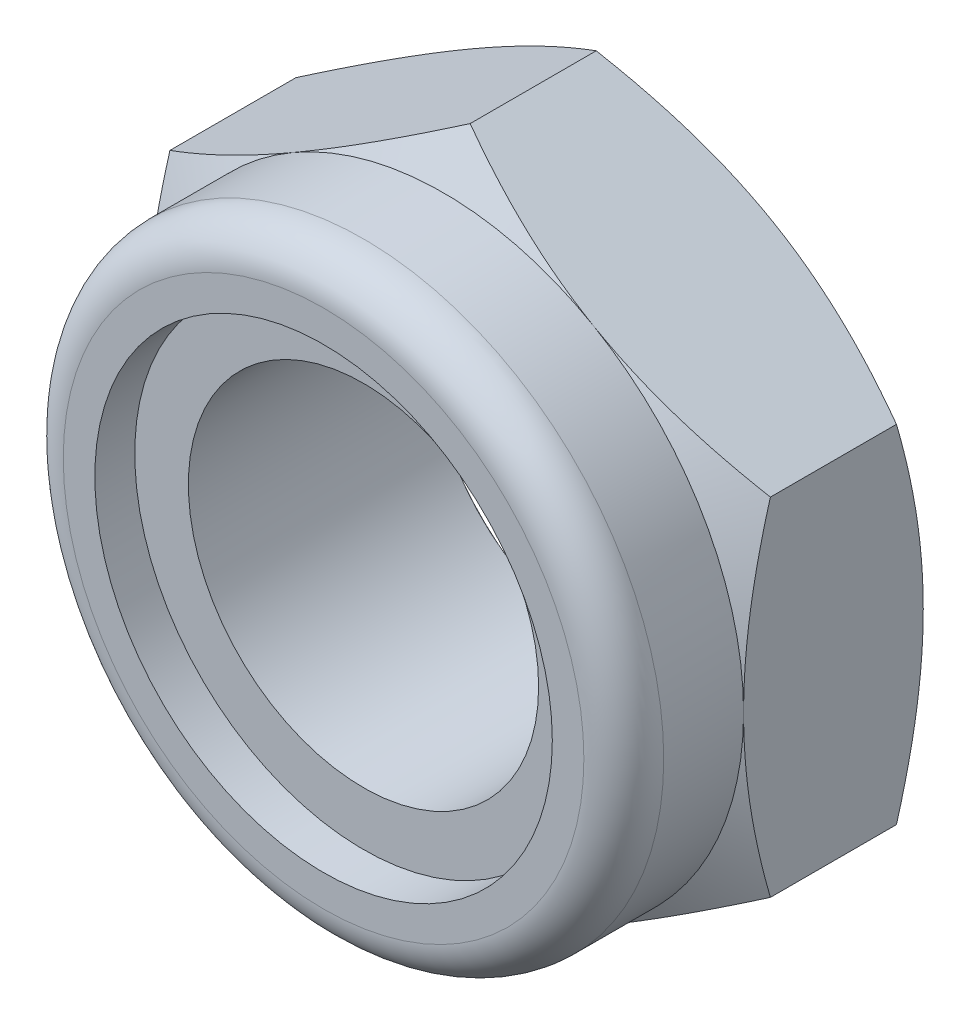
ISO-10303-21;
HEADER;
FILE_DESCRIPTION(('STEP AP214'),'2;1');
FILE_NAME('part.step','',(''),(''),'','','');
FILE_SCHEMA(('AUTOMOTIVE_DESIGN { 1 0 10303 214 1 1 1 1 }'));
ENDSEC;
DATA;
#1=APPLICATION_CONTEXT('core data for automotive mechanical design processes');
#2=APPLICATION_PROTOCOL_DEFINITION('international standard','automotive_design',2000,#1);
#3=PRODUCT_CONTEXT('',#1,'mechanical');
#4=PRODUCT('Part','Part','',(#3));
#5=PRODUCT_RELATED_PRODUCT_CATEGORY('part','',(#4));
#6=PRODUCT_DEFINITION_FORMATION('','',#4);
#7=PRODUCT_DEFINITION_CONTEXT('part definition',#1,'design');
#8=PRODUCT_DEFINITION('design','',#6,#7);
#9=PRODUCT_DEFINITION_SHAPE('','',#8);
#10=(LENGTH_UNIT() NAMED_UNIT(*) SI_UNIT(.MILLI.,.METRE.));
#11=(NAMED_UNIT(*) PLANE_ANGLE_UNIT() SI_UNIT($,.RADIAN.));
#12=(NAMED_UNIT(*) SI_UNIT($,.STERADIAN.) SOLID_ANGLE_UNIT());
#13=UNCERTAINTY_MEASURE_WITH_UNIT(LENGTH_MEASURE(1.E-05),#10,'distance_accuracy_value','');
#14=(GEOMETRIC_REPRESENTATION_CONTEXT(3) GLOBAL_UNCERTAINTY_ASSIGNED_CONTEXT((#13)) GLOBAL_UNIT_ASSIGNED_CONTEXT((#10,
#11,#12)) REPRESENTATION_CONTEXT('',''));
#15=CARTESIAN_POINT('',(0.,0.,0.));
#16=DIRECTION('',(0.,0.,1.));
#17=DIRECTION('',(1.,0.,0.));
#18=AXIS2_PLACEMENT_3D('',#15,#16,#17);
#19=CARTESIAN_POINT('',(0.,0.,-11.4));
#20=DIRECTION('',(0.,0.,1.));
#21=DIRECTION('',(1.,0.,0.));
#22=AXIS2_PLACEMENT_3D('',#19,#20,#21);
#23=CYLINDRICAL_SURFACE('',#22,11.1125);
#24=CARTESIAN_POINT('',(0.,0.,5.06666666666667));
#25=DIRECTION('',(0.,0.,1.));
#26=DIRECTION('',(1.,0.,0.));
#27=AXIS2_PLACEMENT_3D('',#24,#25,#26);
#28=CIRCLE('',#27,11.1125);
#29=CARTESIAN_POINT('',(11.1125,0.,5.06666666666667));
#30=VERTEX_POINT('',#29);
#31=EDGE_CURVE('E277',#30,#30,#28,.T.);
#32=ORIENTED_EDGE('',*,*,#31,.T.);
#33=EDGE_LOOP('',(#32));
#34=FACE_BOUND('',#33,.T.);
#35=CARTESIAN_POINT('',(0.,0.,-10.2630205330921));
#36=DIRECTION('',(0.,0.,-1.));
#37=DIRECTION('',(-1.,0.,0.));
#38=AXIS2_PLACEMENT_3D('',#35,#36,#37);
#39=CIRCLE('',#38,11.1125);
#40=CARTESIAN_POINT('',(-11.1125,0.,-10.2630205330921));
#41=VERTEX_POINT('',#40);
#42=EDGE_CURVE('E39',#41,#41,#39,.F.);
#43=ORIENTED_EDGE('',*,*,#42,.F.);
#44=EDGE_LOOP('',(#43));
#45=FACE_BOUND('',#44,.T.);
#46=ADVANCED_FACE('F34',(#34,#45),#23,.F.);
#47=CARTESIAN_POINT('',(0.,21.9970452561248,-11.4));
#48=DIRECTION('',(-0.500000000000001,0.866025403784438,0.));
#49=DIRECTION('',(-0.866025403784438,-0.500000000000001,0.));
#50=AXIS2_PLACEMENT_3D('',#47,#48,#49);
#51=PLANE('',#50);
#52=DIRECTION('',(0.,0.,1.));
#53=VECTOR('',#52,1.);
#54=CARTESIAN_POINT('',(-19.05,10.9985226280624,-11.4));
#55=LINE('',#54,#53);
#56=CARTESIAN_POINT('',(-19.05,10.9985226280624,-9.69852262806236));
#57=VERTEX_POINT('',#56);
#58=CARTESIAN_POINT('',(-19.05,10.9985226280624,-1.70147737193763));
#59=VERTEX_POINT('',#58);
#60=EDGE_CURVE('E249',#57,#59,#55,.T.);
#61=ORIENTED_EDGE('',*,*,#60,.T.);
#62=CARTESIAN_POINT('',(-19.0502,10.9984071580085,-1.70154403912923));
#63=CARTESIAN_POINT('',(-18.6314889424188,11.2401500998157,-1.56198341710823));
#64=CARTESIAN_POINT('',(-18.2111446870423,11.4828359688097,-1.42875584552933));
#65=CARTESIAN_POINT('',(-17.3670855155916,11.9701537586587,-1.17672716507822));
#66=CARTESIAN_POINT('',(-16.9433695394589,12.2147862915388,-1.05793080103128));
#67=CARTESIAN_POINT('',(-16.0917480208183,12.7064702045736,-0.836361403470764));
#68=CARTESIAN_POINT('',(-15.6638350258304,12.9535258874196,-0.733626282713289));
#69=CARTESIAN_POINT('',(-14.8050356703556,13.4493539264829,-0.546385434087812));
#70=CARTESIAN_POINT('',(-14.374149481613,13.6981261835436,-0.461878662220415));
#71=CARTESIAN_POINT('',(-13.5204444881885,14.1910129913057,-0.314688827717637));
#72=CARTESIAN_POINT('',(-13.0976890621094,14.4350909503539,-0.2515185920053));
#73=CARTESIAN_POINT('',(-12.250241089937,14.9243652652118,-0.14559634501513));
#74=CARTESIAN_POINT('',(-11.8255485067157,15.1695616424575,-0.10284472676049));
#75=CARTESIAN_POINT('',(-10.9754499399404,15.6603662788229,-0.0388391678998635));
#76=CARTESIAN_POINT('',(-10.5500454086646,15.9059736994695,-0.017559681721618));
#77=CARTESIAN_POINT('',(-9.6988436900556,16.397415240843,0.00304398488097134));
#78=CARTESIAN_POINT('',(-9.27304651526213,16.6432493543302,0.00236884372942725));
#79=CARTESIAN_POINT('',(-8.47700964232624,17.1028414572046,-0.0194033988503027));
#80=CARTESIAN_POINT('',(-8.10671322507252,17.316632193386,-0.0378455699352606));
#81=CARTESIAN_POINT('',(-7.3670036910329,17.7437036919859,-0.0909844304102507));
#82=CARTESIAN_POINT('',(-6.99759056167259,17.9569844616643,-0.125680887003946));
#83=CARTESIAN_POINT('',(-6.25978756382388,18.3829552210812,-0.210726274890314));
#84=CARTESIAN_POINT('',(-5.89139892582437,18.5956445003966,-0.261089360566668));
#85=CARTESIAN_POINT('',(-5.1563753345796,19.0200105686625,-0.376579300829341));
#86=CARTESIAN_POINT('',(-4.7897403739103,19.2316873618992,-0.441706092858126));
#87=CARTESIAN_POINT('',(-3.67677271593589,19.8742595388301,-0.660888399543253));
#88=CARTESIAN_POINT('',(-2.93366305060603,20.3032941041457,-0.836799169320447));
#89=CARTESIAN_POINT('',(-1.45852420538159,21.1549659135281,-1.23604434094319));
#90=CARTESIAN_POINT('',(-0.726476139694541,21.5776140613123,-1.45928498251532));
#91=CARTESIAN_POINT('',(0.000199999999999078,21.9971607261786,-1.70154403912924));
#92=B_SPLINE_CURVE_WITH_KNOTS('',3,(#62,#63,#64,#65,#66,#67,#68,#69,#70,#71,#72,#73,#74,#75,#76,
#77,#78,#79,#80,#81,#82,#83,#84,#85,#86,#87,#88,#89,#90,#91),.UNSPECIFIED.,.F.,.F.,(4,2,2,2,2,2,
2,2,2,2,2,2,2,2,4),(0.,1.50971559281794,3.01992622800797,4.53364959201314,6.04728623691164,
7.52356313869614,8.99986845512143,10.4744153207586,11.9489166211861,13.2325441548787,
14.5161533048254,15.8009255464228,17.085692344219,19.7118183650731,22.3327898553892),.UNSPECIFIED.);
#93=CARTESIAN_POINT('',(-9.52500000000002,16.4977839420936,0.));
#94=VERTEX_POINT('',#93);
#95=EDGE_CURVE('E61',#59,#94,#92,.T.);
#96=ORIENTED_EDGE('',*,*,#95,.T.);
#97=CARTESIAN_POINT('',(0.,21.9970452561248,-1.70147737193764));
#98=VERTEX_POINT('',#97);
#99=EDGE_CURVE('E140',#94,#98,#92,.T.);
#100=ORIENTED_EDGE('',*,*,#99,.T.);
#101=DIRECTION('',(0.,0.,1.));
#102=VECTOR('',#101,1.);
#103=CARTESIAN_POINT('',(0.,21.9970452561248,-11.4));
#104=LINE('',#103,#102);
#105=CARTESIAN_POINT('',(0.,21.9970452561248,-9.69852262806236));
#106=VERTEX_POINT('',#105);
#107=EDGE_CURVE('E137',#106,#98,#104,.T.);
#108=ORIENTED_EDGE('',*,*,#107,.F.);
#109=CARTESIAN_POINT('',(-19.0502,10.9984071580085,-9.69845596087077));
#110=CARTESIAN_POINT('',(-18.6314889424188,11.2401500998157,-9.83801658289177));
#111=CARTESIAN_POINT('',(-18.2111446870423,11.4828359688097,-9.97124415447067));
#112=CARTESIAN_POINT('',(-17.3670855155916,11.9701537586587,-10.2232728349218));
#113=CARTESIAN_POINT('',(-16.9433695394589,12.2147862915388,-10.3420691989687));
#114=CARTESIAN_POINT('',(-16.0917480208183,12.7064702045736,-10.5636385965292));
#115=CARTESIAN_POINT('',(-15.6638350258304,12.9535258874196,-10.6663737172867));
#116=CARTESIAN_POINT('',(-14.8050356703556,13.4493539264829,-10.8536145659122));
#117=CARTESIAN_POINT('',(-14.374149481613,13.6981261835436,-10.9381213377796));
#118=CARTESIAN_POINT('',(-13.5204444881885,14.1910129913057,-11.0853111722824));
#119=CARTESIAN_POINT('',(-13.0976890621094,14.4350909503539,-11.1484814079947));
#120=CARTESIAN_POINT('',(-12.250241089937,14.9243652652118,-11.2544036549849));
#121=CARTESIAN_POINT('',(-11.8255485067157,15.1695616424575,-11.2971552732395));
#122=CARTESIAN_POINT('',(-10.9754499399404,15.6603662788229,-11.3611608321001));
#123=CARTESIAN_POINT('',(-10.5500454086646,15.9059736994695,-11.3824403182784));
#124=CARTESIAN_POINT('',(-9.6988436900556,16.397415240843,-11.403043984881));
#125=CARTESIAN_POINT('',(-9.27304651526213,16.6432493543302,-11.4023688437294));
#126=CARTESIAN_POINT('',(-8.47700964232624,17.1028414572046,-11.3805966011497));
#127=CARTESIAN_POINT('',(-8.10671322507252,17.316632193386,-11.3621544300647));
#128=CARTESIAN_POINT('',(-7.3670036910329,17.7437036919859,-11.3090155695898));
#129=CARTESIAN_POINT('',(-6.99759056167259,17.9569844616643,-11.2743191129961));
#130=CARTESIAN_POINT('',(-6.25978756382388,18.3829552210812,-11.1892737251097));
#131=CARTESIAN_POINT('',(-5.89139892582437,18.5956445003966,-11.1389106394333));
#132=CARTESIAN_POINT('',(-5.1563753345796,19.0200105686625,-11.0234206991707));
#133=CARTESIAN_POINT('',(-4.7897403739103,19.2316873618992,-10.9582939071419));
#134=CARTESIAN_POINT('',(-3.67677271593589,19.8742595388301,-10.7391116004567));
#135=CARTESIAN_POINT('',(-2.93366305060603,20.3032941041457,-10.5632008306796));
#136=CARTESIAN_POINT('',(-1.45852420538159,21.1549659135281,-10.1639556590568));
#137=CARTESIAN_POINT('',(-0.726476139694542,21.5776140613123,-9.94071501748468));
#138=CARTESIAN_POINT('',(0.000199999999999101,21.9971607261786,-9.69845596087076));
#139=B_SPLINE_CURVE_WITH_KNOTS('',3,(#109,#110,#111,#112,#113,#114,#115,#116,#117,#118,#119,
#120,#121,#122,#123,#124,#125,#126,#127,#128,#129,#130,#131,#132,#133,#134,#135,#136,#137,#138),
.UNSPECIFIED.,.F.,.F.,(4,2,2,2,2,2,2,2,2,2,2,2,2,2,4),(0.,1.50971559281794,3.01992622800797,
4.53364959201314,6.04728623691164,7.52356313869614,8.99986845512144,10.4744153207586,
11.9489166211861,13.2325441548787,14.5161533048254,15.8009255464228,17.085692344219,
19.7118183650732,22.3327898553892),.UNSPECIFIED.);
#140=CARTESIAN_POINT('',(-9.52500000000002,16.4977839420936,-11.4));
#141=VERTEX_POINT('',#140);
#142=EDGE_CURVE('E252',#141,#106,#139,.T.);
#143=ORIENTED_EDGE('',*,*,#142,.F.);
#144=EDGE_CURVE('E231',#57,#141,#139,.T.);
#145=ORIENTED_EDGE('',*,*,#144,.F.);
#146=EDGE_LOOP('',(#61,#96,#100,#108,#143,#145));
#147=FACE_BOUND('',#146,.T.);
#148=ADVANCED_FACE('F36',(#147),#51,.T.);
#149=CARTESIAN_POINT('',(19.05,10.9985226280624,-11.4));
#150=DIRECTION('',(0.500000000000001,0.866025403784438,0.));
#151=DIRECTION('',(-0.866025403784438,0.500000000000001,0.));
#152=AXIS2_PLACEMENT_3D('',#149,#150,#151);
#153=PLANE('',#152);
#154=ORIENTED_EDGE('',*,*,#107,.T.);
#155=CARTESIAN_POINT('',(-0.000200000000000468,21.9971607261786,-1.70154403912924));
#156=CARTESIAN_POINT('',(0.418511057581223,21.7554177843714,-1.56198341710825));
#157=CARTESIAN_POINT('',(0.838855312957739,21.5127319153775,-1.42875584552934));
#158=CARTESIAN_POINT('',(1.68291448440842,21.0254141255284,-1.17672716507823));
#159=CARTESIAN_POINT('',(2.10663046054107,20.7807815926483,-1.05793080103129));
#160=CARTESIAN_POINT('',(2.95825197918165,20.2890976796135,-0.836361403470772));
#161=CARTESIAN_POINT('',(3.38616497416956,20.0420419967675,-0.733626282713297));
#162=CARTESIAN_POINT('',(4.24496432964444,19.5462139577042,-0.54638543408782));
#163=CARTESIAN_POINT('',(4.67585051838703,19.2974417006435,-0.461878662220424));
#164=CARTESIAN_POINT('',(5.52955551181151,18.8045548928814,-0.314688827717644));
#165=CARTESIAN_POINT('',(5.95231093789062,18.5604769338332,-0.251518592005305));
#166=CARTESIAN_POINT('',(6.79975891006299,18.0712026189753,-0.145596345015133));
#167=CARTESIAN_POINT('',(7.22445149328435,17.8260062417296,-0.102844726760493));
#168=CARTESIAN_POINT('',(8.07455006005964,17.3352016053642,-0.0388391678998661));
#169=CARTESIAN_POINT('',(8.49995459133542,17.0895941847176,-0.0175596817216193));
#170=CARTESIAN_POINT('',(9.35115630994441,16.5981526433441,0.00304398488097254));
#171=CARTESIAN_POINT('',(9.77695348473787,16.3523185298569,0.00236884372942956));
#172=CARTESIAN_POINT('',(10.5729903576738,15.8927264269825,-0.0194033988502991));
#173=CARTESIAN_POINT('',(10.9432867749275,15.6789356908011,-0.0378455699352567));
#174=CARTESIAN_POINT('',(11.6829963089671,15.2518641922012,-0.0909844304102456));
#175=CARTESIAN_POINT('',(12.0524094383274,15.0385834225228,-0.12568088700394));
#176=CARTESIAN_POINT('',(12.7902124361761,14.612612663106,-0.210726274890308));
#177=CARTESIAN_POINT('',(13.1586010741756,14.3999233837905,-0.261089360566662));
#178=CARTESIAN_POINT('',(13.8936246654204,13.9755573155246,-0.376579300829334));
#179=CARTESIAN_POINT('',(14.2602596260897,13.7638805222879,-0.441706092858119));
#180=CARTESIAN_POINT('',(15.3732272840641,13.121308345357,-0.660888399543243));
#181=CARTESIAN_POINT('',(16.116336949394,12.6922737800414,-0.836799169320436));
#182=CARTESIAN_POINT('',(17.5914757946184,11.840601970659,-1.23604434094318));
#183=CARTESIAN_POINT('',(18.3235238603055,11.4179538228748,-1.45928498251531));
#184=CARTESIAN_POINT('',(19.0502,10.9984071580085,-1.70154403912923));
#185=B_SPLINE_CURVE_WITH_KNOTS('',3,(#155,#156,#157,#158,#159,#160,#161,#162,#163,#164,#165,
#166,#167,#168,#169,#170,#171,#172,#173,#174,#175,#176,#177,#178,#179,#180,#181,#182,#183,#184),
.UNSPECIFIED.,.F.,.F.,(4,2,2,2,2,2,2,2,2,2,2,2,2,2,4),(0.,1.50971559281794,3.01992622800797,
4.53364959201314,6.04728623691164,7.52356313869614,8.99986845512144,10.4744153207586,
11.9489166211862,13.2325441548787,14.5161533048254,15.8009255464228,17.085692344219,
19.7118183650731,22.3327898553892),.UNSPECIFIED.);
#186=CARTESIAN_POINT('',(9.52500000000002,16.4977839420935,0.));
#187=VERTEX_POINT('',#186);
#188=EDGE_CURVE('E129',#98,#187,#185,.T.);
#189=ORIENTED_EDGE('',*,*,#188,.T.);
#190=CARTESIAN_POINT('',(19.05,10.9985226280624,-1.70147737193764));
#191=VERTEX_POINT('',#190);
#192=EDGE_CURVE('E133',#187,#191,#185,.T.);
#193=ORIENTED_EDGE('',*,*,#192,.T.);
#194=DIRECTION('',(0.,0.,1.));
#195=VECTOR('',#194,1.);
#196=CARTESIAN_POINT('',(19.05,10.9985226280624,-11.4));
#197=LINE('',#196,#195);
#198=CARTESIAN_POINT('',(19.05,10.9985226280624,-9.69852262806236));
#199=VERTEX_POINT('',#198);
#200=EDGE_CURVE('E238',#199,#191,#197,.T.);
#201=ORIENTED_EDGE('',*,*,#200,.F.);
#202=CARTESIAN_POINT('',(-0.000200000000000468,21.9971607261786,-9.69845596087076));
#203=CARTESIAN_POINT('',(0.418511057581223,21.7554177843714,-9.83801658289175));
#204=CARTESIAN_POINT('',(0.83885531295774,21.5127319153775,-9.97124415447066));
#205=CARTESIAN_POINT('',(1.68291448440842,21.0254141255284,-10.2232728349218));
#206=CARTESIAN_POINT('',(2.10663046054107,20.7807815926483,-10.3420691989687));
#207=CARTESIAN_POINT('',(2.95825197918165,20.2890976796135,-10.5636385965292));
#208=CARTESIAN_POINT('',(3.38616497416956,20.0420419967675,-10.6663737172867));
#209=CARTESIAN_POINT('',(4.24496432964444,19.5462139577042,-10.8536145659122));
#210=CARTESIAN_POINT('',(4.67585051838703,19.2974417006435,-10.9381213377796));
#211=CARTESIAN_POINT('',(5.52955551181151,18.8045548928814,-11.0853111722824));
#212=CARTESIAN_POINT('',(5.95231093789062,18.5604769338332,-11.1484814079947));
#213=CARTESIAN_POINT('',(6.79975891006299,18.0712026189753,-11.2544036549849));
#214=CARTESIAN_POINT('',(7.22445149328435,17.8260062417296,-11.2971552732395));
#215=CARTESIAN_POINT('',(8.07455006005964,17.3352016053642,-11.3611608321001));
#216=CARTESIAN_POINT('',(8.49995459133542,17.0895941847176,-11.3824403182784));
#217=CARTESIAN_POINT('',(9.35115630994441,16.5981526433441,-11.403043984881));
#218=CARTESIAN_POINT('',(9.77695348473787,16.3523185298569,-11.4023688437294));
#219=CARTESIAN_POINT('',(10.5729903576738,15.8927264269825,-11.3805966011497));
#220=CARTESIAN_POINT('',(10.9432867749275,15.6789356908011,-11.3621544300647));
#221=CARTESIAN_POINT('',(11.6829963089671,15.2518641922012,-11.3090155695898));
#222=CARTESIAN_POINT('',(12.0524094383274,15.0385834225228,-11.2743191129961));
#223=CARTESIAN_POINT('',(12.7902124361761,14.612612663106,-11.1892737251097));
#224=CARTESIAN_POINT('',(13.1586010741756,14.3999233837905,-11.1389106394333));
#225=CARTESIAN_POINT('',(13.8936246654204,13.9755573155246,-11.0234206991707));
#226=CARTESIAN_POINT('',(14.2602596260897,13.7638805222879,-10.9582939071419));
#227=CARTESIAN_POINT('',(15.3732272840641,13.121308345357,-10.7391116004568));
#228=CARTESIAN_POINT('',(16.116336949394,12.6922737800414,-10.5632008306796));
#229=CARTESIAN_POINT('',(17.5914757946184,11.840601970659,-10.1639556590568));
#230=CARTESIAN_POINT('',(18.3235238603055,11.4179538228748,-9.94071501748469));
#231=CARTESIAN_POINT('',(19.0502,10.9984071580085,-9.69845596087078));
#232=B_SPLINE_CURVE_WITH_KNOTS('',3,(#202,#203,#204,#205,#206,#207,#208,#209,#210,#211,#212,
#213,#214,#215,#216,#217,#218,#219,#220,#221,#222,#223,#224,#225,#226,#227,#228,#229,#230,#231),
.UNSPECIFIED.,.F.,.F.,(4,2,2,2,2,2,2,2,2,2,2,2,2,2,4),(0.,1.50971559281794,3.01992622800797,
4.53364959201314,6.04728623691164,7.52356313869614,8.99986845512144,10.4744153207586,
11.9489166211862,13.2325441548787,14.5161533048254,15.8009255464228,17.085692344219,
19.7118183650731,22.3327898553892),.UNSPECIFIED.);
#233=CARTESIAN_POINT('',(9.52500000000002,16.4977839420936,-11.4));
#234=VERTEX_POINT('',#233);
#235=EDGE_CURVE('E223',#234,#199,#232,.T.);
#236=ORIENTED_EDGE('',*,*,#235,.F.);
#237=EDGE_CURVE('E229',#106,#234,#232,.T.);
#238=ORIENTED_EDGE('',*,*,#237,.F.);
#239=EDGE_LOOP('',(#154,#189,#193,#201,#236,#238));
#240=FACE_BOUND('',#239,.T.);
#241=ADVANCED_FACE('F131',(#240),#153,.T.);
#242=CARTESIAN_POINT('',(19.05,10.9985226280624,-11.4));
#243=DIRECTION('',(-1.,0.,0.));
#244=DIRECTION('',(0.,0.,1.));
#245=AXIS2_PLACEMENT_3D('',#242,#243,#244);
#246=PLANE('',#245);
#247=CARTESIAN_POINT('',(19.05,-29.169702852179,-9.11593373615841));
#248=CARTESIAN_POINT('',(19.05,-28.7515170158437,-8.91378890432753));
#249=CARTESIAN_POINT('',(19.05,-28.3328257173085,-8.7126902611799));
#250=CARTESIAN_POINT('',(19.05,-27.494325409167,-8.31282549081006));
#251=CARTESIAN_POINT('',(19.05,-27.0745163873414,-8.11405938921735));
#252=CARTESIAN_POINT('',(19.05,-25.813129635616,-7.52156252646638));
#253=CARTESIAN_POINT('',(19.05,-24.9697281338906,-7.1316990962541));
#254=CARTESIAN_POINT('',(19.05,-23.2722707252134,-6.36257122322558));
#255=CARTESIAN_POINT('',(19.05,-22.4181814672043,-5.98338020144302));
#256=CARTESIAN_POINT('',(19.05,-20.7029839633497,-5.24127883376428));
#257=CARTESIAN_POINT('',(19.05,-19.8418760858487,-4.87836763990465));
#258=CARTESIAN_POINT('',(19.05,-18.1005821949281,-4.16885698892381));
#259=CARTESIAN_POINT('',(19.05,-17.2202917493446,-3.82251248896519));
#260=CARTESIAN_POINT('',(19.05,-15.4493217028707,-3.15694792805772));
#261=CARTESIAN_POINT('',(19.05,-14.5586409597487,-2.83773088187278));
#262=CARTESIAN_POINT('',(19.05,-12.7673320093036,-2.2350028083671));
#263=CARTESIAN_POINT('',(19.05,-11.8667295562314,-1.95141586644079));
#264=CARTESIAN_POINT('',(19.05,-10.0526343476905,-1.42914392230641));
#265=CARTESIAN_POINT('',(19.05,-9.13914576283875,-1.19044473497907));
#266=CARTESIAN_POINT('',(19.05,-7.7590746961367,-0.874799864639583));
#267=CARTESIAN_POINT('',(19.05,-7.29731333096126,-0.776636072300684));
#268=CARTESIAN_POINT('',(19.05,-6.37071732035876,-0.595993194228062));
#269=CARTESIAN_POINT('',(19.05,-5.90588274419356,-0.513513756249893));
#270=CARTESIAN_POINT('',(19.05,-4.97345228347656,-0.36570182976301));
#271=CARTESIAN_POINT('',(19.05,-4.50585623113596,-0.300370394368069));
#272=CARTESIAN_POINT('',(19.05,-3.56843861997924,-0.188166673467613));
#273=CARTESIAN_POINT('',(19.05,-3.09861705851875,-0.141294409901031));
#274=CARTESIAN_POINT('',(19.05,-2.16041609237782,-0.0672708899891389));
#275=CARTESIAN_POINT('',(19.05,-1.69204648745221,-0.0399962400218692));
#276=CARTESIAN_POINT('',(19.05,-0.754574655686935,-0.00531133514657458));
#277=CARTESIAN_POINT('',(19.05,-0.28547244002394,0.00209921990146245));
#278=CARTESIAN_POINT('',(19.05,0.652492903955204,-0.0031198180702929));
#279=CARTESIAN_POINT('',(19.05,1.12135606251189,-0.015743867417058));
#280=CARTESIAN_POINT('',(19.05,2.05813737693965,-0.0607182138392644));
#281=CARTESIAN_POINT('',(19.05,2.52605549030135,-0.0930693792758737));
#282=CARTESIAN_POINT('',(19.05,3.65980250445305,-0.194680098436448));
#283=CARTESIAN_POINT('',(19.05,4.32476458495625,-0.273803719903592));
#284=CARTESIAN_POINT('',(19.05,5.64947952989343,-0.467485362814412));
#285=CARTESIAN_POINT('',(19.05,6.30923160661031,-0.582048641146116));
#286=CARTESIAN_POINT('',(19.05,8.28182382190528,-0.973151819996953));
#287=CARTESIAN_POINT('',(19.05,9.58542312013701,-1.29684470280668));
#288=CARTESIAN_POINT('',(19.05,11.5353898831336,-1.85499845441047));
#289=CARTESIAN_POINT('',(19.05,12.191945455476,-2.05588340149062));
#290=CARTESIAN_POINT('',(19.05,13.498713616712,-2.47768236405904));
#291=CARTESIAN_POINT('',(19.05,14.1489256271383,-2.69859818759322));
#292=CARTESIAN_POINT('',(19.05,15.4397656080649,-3.15575174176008));
#293=CARTESIAN_POINT('',(19.05,16.080426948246,-3.39189604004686));
#294=CARTESIAN_POINT('',(19.05,17.0373840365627,-3.75633654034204));
#295=CARTESIAN_POINT('',(19.05,17.3556458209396,-3.87949985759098));
#296=CARTESIAN_POINT('',(19.05,17.9909330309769,-4.12895791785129));
#297=CARTESIAN_POINT('',(19.05,18.3079584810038,-4.25525259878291));
#298=CARTESIAN_POINT('',(19.05,18.6244086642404,-4.38297164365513));
#299=B_SPLINE_CURVE_WITH_KNOTS('',3,(#247,#248,#249,#250,#251,#252,#253,#254,#255,#256,#257,
#258,#259,#260,#261,#262,#263,#264,#265,#266,#267,#268,#269,#270,#271,#272,#273,#274,#275,#276,
#277,#278,#279,#280,#281,#282,#283,#284,#285,#286,#287,#288,#289,#290,#291,#292,#293,#294,#295,
#296,#297,#298),.UNSPECIFIED.,.F.,.F.,(4,2,2,2,2,2,2,2,2,2,2,2,2,2,2,2,2,2,2,2,2,2,2,2,2,4),(0.,
1.39343811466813,2.78689152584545,5.57425145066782,8.37756231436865,11.1807269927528,
14.0183059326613,16.856199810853,19.6879407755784,22.5187853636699,23.934802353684,
25.3507875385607,26.766859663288,28.1829334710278,29.5900111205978,30.9970675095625,
32.4037346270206,33.8104636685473,35.8182820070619,37.8263983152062,41.8503661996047,
43.9100054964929,45.9698308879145,48.0180400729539,49.0418117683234,50.0655631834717),.UNSPECIFIED.);
#300=CARTESIAN_POINT('',(19.05,-10.9985226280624,-1.70147737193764));
#301=VERTEX_POINT('',#300);
#302=CARTESIAN_POINT('',(19.05,0.,0.));
#303=VERTEX_POINT('',#302);
#304=EDGE_CURVE('E199',#301,#303,#299,.T.);
#305=ORIENTED_EDGE('',*,*,#304,.F.);
#306=DIRECTION('',(0.,0.,1.));
#307=VECTOR('',#306,1.);
#308=CARTESIAN_POINT('',(19.05,-10.9985226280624,-11.4));
#309=LINE('',#308,#307);
#310=CARTESIAN_POINT('',(19.05,-10.9985226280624,-9.69852262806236));
#311=VERTEX_POINT('',#310);
#312=EDGE_CURVE('E240',#311,#301,#309,.T.);
#313=ORIENTED_EDGE('',*,*,#312,.F.);
#314=CARTESIAN_POINT('',(19.05,-29.169702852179,-2.2840662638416));
#315=CARTESIAN_POINT('',(19.05,-28.7515170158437,-2.48621109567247));
#316=CARTESIAN_POINT('',(19.05,-28.3328257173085,-2.68730973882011));
#317=CARTESIAN_POINT('',(19.05,-27.494325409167,-3.08717450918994));
#318=CARTESIAN_POINT('',(19.05,-27.0745163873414,-3.28594061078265));
#319=CARTESIAN_POINT('',(19.05,-25.813129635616,-3.87843747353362));
#320=CARTESIAN_POINT('',(19.05,-24.9697281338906,-4.2683009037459));
#321=CARTESIAN_POINT('',(19.05,-23.2722707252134,-5.03742877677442));
#322=CARTESIAN_POINT('',(19.05,-22.4181814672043,-5.41661979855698));
#323=CARTESIAN_POINT('',(19.05,-20.7029839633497,-6.15872116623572));
#324=CARTESIAN_POINT('',(19.05,-19.8418760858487,-6.52163236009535));
#325=CARTESIAN_POINT('',(19.05,-18.1005821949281,-7.23114301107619));
#326=CARTESIAN_POINT('',(19.05,-17.2202917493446,-7.57748751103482));
#327=CARTESIAN_POINT('',(19.05,-15.4493217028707,-8.24305207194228));
#328=CARTESIAN_POINT('',(19.05,-14.5586409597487,-8.56226911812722));
#329=CARTESIAN_POINT('',(19.05,-12.7673320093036,-9.1649971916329));
#330=CARTESIAN_POINT('',(19.05,-11.8667295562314,-9.44858413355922));
#331=CARTESIAN_POINT('',(19.05,-10.0526343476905,-9.9708560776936));
#332=CARTESIAN_POINT('',(19.05,-9.13914576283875,-10.2095552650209));
#333=CARTESIAN_POINT('',(19.05,-7.7590746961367,-10.5252001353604));
#334=CARTESIAN_POINT('',(19.05,-7.29731333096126,-10.6233639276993));
#335=CARTESIAN_POINT('',(19.05,-6.37071732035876,-10.8040068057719));
#336=CARTESIAN_POINT('',(19.05,-5.90588274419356,-10.8864862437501));
#337=CARTESIAN_POINT('',(19.05,-4.97345228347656,-11.034298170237));
#338=CARTESIAN_POINT('',(19.05,-4.50585623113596,-11.0996296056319));
#339=CARTESIAN_POINT('',(19.05,-3.56843861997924,-11.2118333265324));
#340=CARTESIAN_POINT('',(19.05,-3.09861705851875,-11.258705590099));
#341=CARTESIAN_POINT('',(19.05,-2.16041609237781,-11.3327291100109));
#342=CARTESIAN_POINT('',(19.05,-1.69204648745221,-11.3600037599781));
#343=CARTESIAN_POINT('',(19.05,-0.754574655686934,-11.3946886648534));
#344=CARTESIAN_POINT('',(19.05,-0.285472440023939,-11.4020992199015));
#345=CARTESIAN_POINT('',(19.05,0.652492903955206,-11.3968801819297));
#346=CARTESIAN_POINT('',(19.05,1.12135606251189,-11.3842561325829));
#347=CARTESIAN_POINT('',(19.05,2.05813737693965,-11.3392817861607));
#348=CARTESIAN_POINT('',(19.05,2.52605549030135,-11.3069306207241));
#349=CARTESIAN_POINT('',(19.05,3.65980250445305,-11.2053199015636));
#350=CARTESIAN_POINT('',(19.05,4.32476458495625,-11.1261962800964));
#351=CARTESIAN_POINT('',(19.05,5.64947952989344,-10.9325146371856));
#352=CARTESIAN_POINT('',(19.05,6.30923160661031,-10.8179513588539));
#353=CARTESIAN_POINT('',(19.05,8.28182382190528,-10.4268481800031));
#354=CARTESIAN_POINT('',(19.05,9.58542312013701,-10.1031552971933));
#355=CARTESIAN_POINT('',(19.05,11.5353898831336,-9.54500154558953));
#356=CARTESIAN_POINT('',(19.05,12.191945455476,-9.34411659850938));
#357=CARTESIAN_POINT('',(19.05,13.498713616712,-8.92231763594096));
#358=CARTESIAN_POINT('',(19.05,14.1489256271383,-8.70140181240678));
#359=CARTESIAN_POINT('',(19.05,15.4397656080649,-8.24424825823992));
#360=CARTESIAN_POINT('',(19.05,16.080426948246,-8.00810395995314));
#361=CARTESIAN_POINT('',(19.05,17.0373840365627,-7.64366345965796));
#362=CARTESIAN_POINT('',(19.05,17.3556458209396,-7.52050014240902));
#363=CARTESIAN_POINT('',(19.05,17.9909330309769,-7.27104208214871));
#364=CARTESIAN_POINT('',(19.05,18.3079584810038,-7.14474740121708));
#365=CARTESIAN_POINT('',(19.05,18.6244086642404,-7.01702835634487));
#366=B_SPLINE_CURVE_WITH_KNOTS('',3,(#314,#315,#316,#317,#318,#319,#320,#321,#322,#323,#324,
#325,#326,#327,#328,#329,#330,#331,#332,#333,#334,#335,#336,#337,#338,#339,#340,#341,#342,#343,
#344,#345,#346,#347,#348,#349,#350,#351,#352,#353,#354,#355,#356,#357,#358,#359,#360,#361,#362,
#363,#364,#365),.UNSPECIFIED.,.F.,.F.,(4,2,2,2,2,2,2,2,2,2,2,2,2,2,2,2,2,2,2,2,2,2,2,2,2,4),(0.,
1.39343811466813,2.78689152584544,5.57425145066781,8.37756231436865,11.1807269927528,
14.0183059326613,16.856199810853,19.6879407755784,22.5187853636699,23.934802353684,
25.3507875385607,26.766859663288,28.1829334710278,29.5900111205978,30.9970675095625,
32.4037346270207,33.8104636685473,35.8182820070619,37.8263983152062,41.8503661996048,
43.910005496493,45.9698308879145,48.0180400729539,49.0418117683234,50.0655631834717),.UNSPECIFIED.);
#367=CARTESIAN_POINT('',(19.05,0.,-11.4));
#368=VERTEX_POINT('',#367);
#369=EDGE_CURVE('E383',#311,#368,#366,.T.);
#370=ORIENTED_EDGE('',*,*,#369,.T.);
#371=EDGE_CURVE('E230',#368,#199,#366,.T.);
#372=ORIENTED_EDGE('',*,*,#371,.T.);
#373=ORIENTED_EDGE('',*,*,#200,.T.);
#374=EDGE_CURVE('E147',#303,#191,#299,.T.);
#375=ORIENTED_EDGE('',*,*,#374,.F.);
#376=EDGE_LOOP('',(#305,#313,#370,#372,#373,#375));
#377=FACE_BOUND('',#376,.T.);
#378=ADVANCED_FACE('F218',(#377),#246,.F.);
#379=CARTESIAN_POINT('',(0.,-21.9970452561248,-11.4));
#380=DIRECTION('',(0.500000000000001,-0.866025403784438,0.));
#381=DIRECTION('',(0.866025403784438,0.500000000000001,0.));
#382=AXIS2_PLACEMENT_3D('',#379,#380,#381);
#383=PLANE('',#382);
#384=ORIENTED_EDGE('',*,*,#312,.T.);
#385=CARTESIAN_POINT('',(19.0502,-10.9984071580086,-1.70154403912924));
#386=CARTESIAN_POINT('',(18.6314889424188,-11.2401500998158,-1.56198341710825));
#387=CARTESIAN_POINT('',(18.2111446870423,-11.4828359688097,-1.42875584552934));
#388=CARTESIAN_POINT('',(17.3670855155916,-11.9701537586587,-1.17672716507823));
#389=CARTESIAN_POINT('',(16.9433695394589,-12.2147862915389,-1.05793080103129));
#390=CARTESIAN_POINT('',(16.0917480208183,-12.7064702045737,-0.836361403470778));
#391=CARTESIAN_POINT('',(15.6638350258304,-12.9535258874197,-0.733626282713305));
#392=CARTESIAN_POINT('',(14.8050356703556,-13.449353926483,-0.54638543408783));
#393=CARTESIAN_POINT('',(14.374149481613,-13.6981261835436,-0.461878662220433));
#394=CARTESIAN_POINT('',(13.5204444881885,-14.1910129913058,-0.314688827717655));
#395=CARTESIAN_POINT('',(13.0976890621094,-14.4350909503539,-0.251518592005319));
#396=CARTESIAN_POINT('',(12.250241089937,-14.9243652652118,-0.145596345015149));
#397=CARTESIAN_POINT('',(11.8255485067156,-15.1695616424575,-0.102844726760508));
#398=CARTESIAN_POINT('',(10.9754499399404,-15.660366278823,-0.0388391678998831));
#399=CARTESIAN_POINT('',(10.5500454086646,-15.9059736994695,-0.0175596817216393));
#400=CARTESIAN_POINT('',(9.69884369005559,-16.3974152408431,0.0030439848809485));
#401=CARTESIAN_POINT('',(9.27304651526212,-16.6432493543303,0.00236884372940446));
#402=CARTESIAN_POINT('',(8.47700964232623,-17.1028414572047,-0.019403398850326));
#403=CARTESIAN_POINT('',(8.10671322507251,-17.3166321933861,-0.0378455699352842));
#404=CARTESIAN_POINT('',(7.36700369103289,-17.743703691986,-0.0909844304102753));
#405=CARTESIAN_POINT('',(6.99759056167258,-17.9569844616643,-0.125680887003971));
#406=CARTESIAN_POINT('',(6.25978756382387,-18.3829552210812,-0.210726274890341));
#407=CARTESIAN_POINT('',(5.89139892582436,-18.5956445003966,-0.261089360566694));
#408=CARTESIAN_POINT('',(5.1563753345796,-19.0200105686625,-0.376579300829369));
#409=CARTESIAN_POINT('',(4.7897403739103,-19.2316873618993,-0.441706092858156));
#410=CARTESIAN_POINT('',(3.67677271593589,-19.8742595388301,-0.660888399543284));
#411=CARTESIAN_POINT('',(2.93366305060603,-20.3032941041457,-0.836799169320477));
#412=CARTESIAN_POINT('',(1.45852420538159,-21.1549659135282,-1.23604434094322));
#413=CARTESIAN_POINT('',(0.726476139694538,-21.5776140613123,-1.45928498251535));
#414=CARTESIAN_POINT('',(-0.000200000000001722,-21.9971607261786,-1.70154403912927));
#415=B_SPLINE_CURVE_WITH_KNOTS('',3,(#385,#386,#387,#388,#389,#390,#391,#392,#393,#394,#395,
#396,#397,#398,#399,#400,#401,#402,#403,#404,#405,#406,#407,#408,#409,#410,#411,#412,#413,#414),
.UNSPECIFIED.,.F.,.F.,(4,2,2,2,2,2,2,2,2,2,2,2,2,2,4),(0.,1.50971559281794,3.01992622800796,
4.53364959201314,6.04728623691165,7.52356313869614,8.99986845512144,10.4744153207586,
11.9489166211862,13.2325441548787,14.5161533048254,15.8009255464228,17.085692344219,
19.7118183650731,22.3327898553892),.UNSPECIFIED.);
#416=CARTESIAN_POINT('',(9.52500000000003,-16.4977839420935,0.));
#417=VERTEX_POINT('',#416);
#418=EDGE_CURVE('E324',#301,#417,#415,.T.);
#419=ORIENTED_EDGE('',*,*,#418,.T.);
#420=CARTESIAN_POINT('',(0.,-21.9970452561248,-1.70147737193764));
#421=VERTEX_POINT('',#420);
#422=EDGE_CURVE('E193',#417,#421,#415,.T.);
#423=ORIENTED_EDGE('',*,*,#422,.T.);
#424=DIRECTION('',(0.,0.,1.));
#425=VECTOR('',#424,1.);
#426=CARTESIAN_POINT('',(0.,-21.9970452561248,-11.4));
#427=LINE('',#426,#425);
#428=CARTESIAN_POINT('',(0.,-21.9970452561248,-9.69852262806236));
#429=VERTEX_POINT('',#428);
#430=EDGE_CURVE('E243',#429,#421,#427,.T.);
#431=ORIENTED_EDGE('',*,*,#430,.F.);
#432=CARTESIAN_POINT('',(19.0502,-10.9984071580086,-9.69845596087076));
#433=CARTESIAN_POINT('',(18.6314889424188,-11.2401500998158,-9.83801658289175));
#434=CARTESIAN_POINT('',(18.2111446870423,-11.4828359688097,-9.97124415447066));
#435=CARTESIAN_POINT('',(17.3670855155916,-11.9701537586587,-10.2232728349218));
#436=CARTESIAN_POINT('',(16.9433695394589,-12.2147862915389,-10.3420691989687));
#437=CARTESIAN_POINT('',(16.0917480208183,-12.7064702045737,-10.5636385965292));
#438=CARTESIAN_POINT('',(15.6638350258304,-12.9535258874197,-10.6663737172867));
#439=CARTESIAN_POINT('',(14.8050356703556,-13.449353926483,-10.8536145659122));
#440=CARTESIAN_POINT('',(14.374149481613,-13.6981261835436,-10.9381213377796));
#441=CARTESIAN_POINT('',(13.5204444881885,-14.1910129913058,-11.0853111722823));
#442=CARTESIAN_POINT('',(13.0976890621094,-14.4350909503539,-11.1484814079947));
#443=CARTESIAN_POINT('',(12.250241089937,-14.9243652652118,-11.2544036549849));
#444=CARTESIAN_POINT('',(11.8255485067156,-15.1695616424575,-11.2971552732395));
#445=CARTESIAN_POINT('',(10.9754499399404,-15.660366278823,-11.3611608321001));
#446=CARTESIAN_POINT('',(10.5500454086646,-15.9059736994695,-11.3824403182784));
#447=CARTESIAN_POINT('',(9.69884369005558,-16.3974152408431,-11.4030439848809));
#448=CARTESIAN_POINT('',(9.27304651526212,-16.6432493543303,-11.4023688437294));
#449=CARTESIAN_POINT('',(8.47700964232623,-17.1028414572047,-11.3805966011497));
#450=CARTESIAN_POINT('',(8.10671322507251,-17.3166321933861,-11.3621544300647));
#451=CARTESIAN_POINT('',(7.36700369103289,-17.743703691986,-11.3090155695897));
#452=CARTESIAN_POINT('',(6.99759056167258,-17.9569844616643,-11.274319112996));
#453=CARTESIAN_POINT('',(6.25978756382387,-18.3829552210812,-11.1892737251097));
#454=CARTESIAN_POINT('',(5.89139892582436,-18.5956445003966,-11.1389106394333));
#455=CARTESIAN_POINT('',(5.1563753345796,-19.0200105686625,-11.0234206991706));
#456=CARTESIAN_POINT('',(4.78974037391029,-19.2316873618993,-10.9582939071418));
#457=CARTESIAN_POINT('',(3.67677271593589,-19.8742595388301,-10.7391116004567));
#458=CARTESIAN_POINT('',(2.93366305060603,-20.3032941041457,-10.5632008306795));
#459=CARTESIAN_POINT('',(1.45852420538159,-21.1549659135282,-10.1639556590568));
#460=CARTESIAN_POINT('',(0.726476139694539,-21.5776140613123,-9.94071501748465));
#461=CARTESIAN_POINT('',(-0.000200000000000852,-21.9971607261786,-9.69845596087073));
#462=B_SPLINE_CURVE_WITH_KNOTS('',3,(#432,#433,#434,#435,#436,#437,#438,#439,#440,#441,#442,
#443,#444,#445,#446,#447,#448,#449,#450,#451,#452,#453,#454,#455,#456,#457,#458,#459,#460,#461),
.UNSPECIFIED.,.F.,.F.,(4,2,2,2,2,2,2,2,2,2,2,2,2,2,4),(0.,1.50971559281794,3.01992622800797,
4.53364959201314,6.04728623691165,7.52356313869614,8.99986845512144,10.4744153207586,
11.9489166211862,13.2325441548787,14.5161533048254,15.8009255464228,17.085692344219,
19.7118183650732,22.3327898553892),.UNSPECIFIED.);
#463=CARTESIAN_POINT('',(9.52500000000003,-16.4977839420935,-11.4));
#464=VERTEX_POINT('',#463);
#465=EDGE_CURVE('E360',#464,#429,#462,.T.);
#466=ORIENTED_EDGE('',*,*,#465,.F.);
#467=EDGE_CURVE('E382',#311,#464,#462,.T.);
#468=ORIENTED_EDGE('',*,*,#467,.F.);
#469=EDGE_LOOP('',(#384,#419,#423,#431,#466,#468));
#470=FACE_BOUND('',#469,.T.);
#471=ADVANCED_FACE('F373',(#470),#383,.T.);
#472=CARTESIAN_POINT('',(-19.05,-10.9985226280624,-11.4));
#473=DIRECTION('',(-0.500000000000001,-0.866025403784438,0.));
#474=DIRECTION('',(0.866025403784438,-0.500000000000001,0.));
#475=AXIS2_PLACEMENT_3D('',#472,#473,#474);
#476=PLANE('',#475);
#477=ORIENTED_EDGE('',*,*,#430,.T.);
#478=CARTESIAN_POINT('',(0.000199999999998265,-21.9971607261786,-1.70154403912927));
#479=CARTESIAN_POINT('',(-0.418511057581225,-21.7554177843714,-1.56198341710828));
#480=CARTESIAN_POINT('',(-0.838855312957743,-21.5127319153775,-1.42875584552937));
#481=CARTESIAN_POINT('',(-1.68291448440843,-21.0254141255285,-1.17672716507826));
#482=CARTESIAN_POINT('',(-2.10663046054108,-20.7807815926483,-1.05793080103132));
#483=CARTESIAN_POINT('',(-2.95825197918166,-20.2890976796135,-0.836361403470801));
#484=CARTESIAN_POINT('',(-3.38616497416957,-20.0420419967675,-0.733626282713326));
#485=CARTESIAN_POINT('',(-4.24496432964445,-19.5462139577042,-0.546385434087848));
#486=CARTESIAN_POINT('',(-4.67585051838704,-19.2974417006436,-0.461878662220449));
#487=CARTESIAN_POINT('',(-5.52955551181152,-18.8045548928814,-0.314688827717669));
#488=CARTESIAN_POINT('',(-5.95231093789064,-18.5604769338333,-0.251518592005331));
#489=CARTESIAN_POINT('',(-6.79975891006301,-18.0712026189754,-0.145596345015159));
#490=CARTESIAN_POINT('',(-7.22445149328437,-17.8260062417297,-0.102844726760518));
#491=CARTESIAN_POINT('',(-8.07455006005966,-17.3352016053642,-0.0388391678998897));
#492=CARTESIAN_POINT('',(-8.49995459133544,-17.0895941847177,-0.0175596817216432));
#493=CARTESIAN_POINT('',(-9.35115630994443,-16.5981526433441,0.00304398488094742));
#494=CARTESIAN_POINT('',(-9.77695348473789,-16.3523185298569,0.0023688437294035));
#495=CARTESIAN_POINT('',(-10.5729903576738,-15.8927264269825,-0.0194033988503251));
#496=CARTESIAN_POINT('',(-10.9432867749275,-15.6789356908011,-0.0378455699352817));
#497=CARTESIAN_POINT('',(-11.6829963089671,-15.2518641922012,-0.0909844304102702));
#498=CARTESIAN_POINT('',(-12.0524094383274,-15.0385834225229,-0.125680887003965));
#499=CARTESIAN_POINT('',(-12.7902124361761,-14.612612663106,-0.210726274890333));
#500=CARTESIAN_POINT('',(-13.1586010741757,-14.3999233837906,-0.261089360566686));
#501=CARTESIAN_POINT('',(-13.8936246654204,-13.9755573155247,-0.376579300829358));
#502=CARTESIAN_POINT('',(-14.2602596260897,-13.7638805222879,-0.441706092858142));
#503=CARTESIAN_POINT('',(-15.3732272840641,-13.1213083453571,-0.660888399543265));
#504=CARTESIAN_POINT('',(-16.116336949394,-12.6922737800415,-0.836799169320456));
#505=CARTESIAN_POINT('',(-17.5914757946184,-11.840601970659,-1.23604434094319));
#506=CARTESIAN_POINT('',(-18.3235238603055,-11.4179538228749,-1.45928498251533));
#507=CARTESIAN_POINT('',(-19.0502,-10.9984071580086,-1.70154403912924));
#508=B_SPLINE_CURVE_WITH_KNOTS('',3,(#478,#479,#480,#481,#482,#483,#484,#485,#486,#487,#488,
#489,#490,#491,#492,#493,#494,#495,#496,#497,#498,#499,#500,#501,#502,#503,#504,#505,#506,#507),
.UNSPECIFIED.,.F.,.F.,(4,2,2,2,2,2,2,2,2,2,2,2,2,2,4),(0.,1.50971559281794,3.01992622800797,
4.53364959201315,6.04728623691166,7.52356313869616,8.99986845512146,10.4744153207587,
11.9489166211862,13.2325441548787,14.5161533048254,15.8009255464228,17.085692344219,
19.7118183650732,22.3327898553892),.UNSPECIFIED.);
#509=CARTESIAN_POINT('',(-9.52500000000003,-16.4977839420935,0.));
#510=VERTEX_POINT('',#509);
#511=EDGE_CURVE('E317',#421,#510,#508,.T.);
#512=ORIENTED_EDGE('',*,*,#511,.T.);
#513=CARTESIAN_POINT('',(-19.05,-10.9985226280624,-1.70147737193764));
#514=VERTEX_POINT('',#513);
#515=EDGE_CURVE('E167',#510,#514,#508,.T.);
#516=ORIENTED_EDGE('',*,*,#515,.T.);
#517=DIRECTION('',(0.,0.,1.));
#518=VECTOR('',#517,1.);
#519=CARTESIAN_POINT('',(-19.05,-10.9985226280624,-11.4));
#520=LINE('',#519,#518);
#521=CARTESIAN_POINT('',(-19.05,-10.9985226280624,-9.69852262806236));
#522=VERTEX_POINT('',#521);
#523=EDGE_CURVE('E246',#522,#514,#520,.T.);
#524=ORIENTED_EDGE('',*,*,#523,.F.);
#525=CARTESIAN_POINT('',(0.000199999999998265,-21.9971607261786,-9.69845596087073));
#526=CARTESIAN_POINT('',(-0.418511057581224,-21.7554177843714,-9.83801658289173));
#527=CARTESIAN_POINT('',(-0.838855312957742,-21.5127319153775,-9.97124415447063));
#528=CARTESIAN_POINT('',(-1.68291448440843,-21.0254141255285,-10.2232728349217));
#529=CARTESIAN_POINT('',(-2.10663046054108,-20.7807815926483,-10.3420691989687));
#530=CARTESIAN_POINT('',(-2.95825197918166,-20.2890976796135,-10.5636385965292));
#531=CARTESIAN_POINT('',(-3.38616497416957,-20.0420419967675,-10.6663737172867));
#532=CARTESIAN_POINT('',(-4.24496432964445,-19.5462139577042,-10.8536145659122));
#533=CARTESIAN_POINT('',(-4.67585051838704,-19.2974417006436,-10.9381213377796));
#534=CARTESIAN_POINT('',(-5.52955551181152,-18.8045548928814,-11.0853111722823));
#535=CARTESIAN_POINT('',(-5.95231093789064,-18.5604769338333,-11.1484814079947));
#536=CARTESIAN_POINT('',(-6.79975891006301,-18.0712026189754,-11.2544036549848));
#537=CARTESIAN_POINT('',(-7.22445149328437,-17.8260062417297,-11.2971552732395));
#538=CARTESIAN_POINT('',(-8.07455006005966,-17.3352016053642,-11.3611608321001));
#539=CARTESIAN_POINT('',(-8.49995459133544,-17.0895941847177,-11.3824403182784));
#540=CARTESIAN_POINT('',(-9.35115630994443,-16.5981526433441,-11.4030439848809));
#541=CARTESIAN_POINT('',(-9.7769534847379,-16.3523185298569,-11.4023688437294));
#542=CARTESIAN_POINT('',(-10.5729903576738,-15.8927264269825,-11.3805966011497));
#543=CARTESIAN_POINT('',(-10.9432867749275,-15.6789356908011,-11.3621544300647));
#544=CARTESIAN_POINT('',(-11.6829963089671,-15.2518641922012,-11.3090155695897));
#545=CARTESIAN_POINT('',(-12.0524094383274,-15.0385834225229,-11.274319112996));
#546=CARTESIAN_POINT('',(-12.7902124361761,-14.612612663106,-11.1892737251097));
#547=CARTESIAN_POINT('',(-13.1586010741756,-14.3999233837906,-11.1389106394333));
#548=CARTESIAN_POINT('',(-13.8936246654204,-13.9755573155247,-11.0234206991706));
#549=CARTESIAN_POINT('',(-14.2602596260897,-13.7638805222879,-10.9582939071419));
#550=CARTESIAN_POINT('',(-15.3732272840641,-13.1213083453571,-10.7391116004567));
#551=CARTESIAN_POINT('',(-16.116336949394,-12.6922737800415,-10.5632008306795));
#552=CARTESIAN_POINT('',(-17.5914757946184,-11.8406019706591,-10.1639556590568));
#553=CARTESIAN_POINT('',(-18.3235238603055,-11.4179538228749,-9.94071501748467));
#554=CARTESIAN_POINT('',(-19.0502,-10.9984071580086,-9.69845596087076));
#555=B_SPLINE_CURVE_WITH_KNOTS('',3,(#525,#526,#527,#528,#529,#530,#531,#532,#533,#534,#535,
#536,#537,#538,#539,#540,#541,#542,#543,#544,#545,#546,#547,#548,#549,#550,#551,#552,#553,#554),
.UNSPECIFIED.,.F.,.F.,(4,2,2,2,2,2,2,2,2,2,2,2,2,2,4),(0.,1.50971559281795,3.01992622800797,
4.53364959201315,6.04728623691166,7.52356313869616,8.99986845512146,10.4744153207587,
11.9489166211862,13.2325441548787,14.5161533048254,15.8009255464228,17.085692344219,
19.7118183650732,22.3327898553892),.UNSPECIFIED.);
#556=CARTESIAN_POINT('',(-9.52500000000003,-16.4977839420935,-11.4));
#557=VERTEX_POINT('',#556);
#558=EDGE_CURVE('E354',#557,#522,#555,.T.);
#559=ORIENTED_EDGE('',*,*,#558,.F.);
#560=EDGE_CURVE('E355',#429,#557,#555,.T.);
#561=ORIENTED_EDGE('',*,*,#560,.F.);
#562=EDGE_LOOP('',(#477,#512,#516,#524,#559,#561));
#563=FACE_BOUND('',#562,.T.);
#564=ADVANCED_FACE('F320',(#563),#476,.T.);
#565=CARTESIAN_POINT('',(-19.05,10.9985226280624,-11.4));
#566=DIRECTION('',(-1.,0.,0.));
#567=DIRECTION('',(0.,0.,1.));
#568=AXIS2_PLACEMENT_3D('',#565,#566,#567);
#569=PLANE('',#568);
#570=ORIENTED_EDGE('',*,*,#523,.T.);
#571=CARTESIAN_POINT('',(-19.05,-29.169702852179,-9.11593373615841));
#572=CARTESIAN_POINT('',(-19.05,-28.7515170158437,-8.91378890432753));
#573=CARTESIAN_POINT('',(-19.05,-28.3328257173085,-8.7126902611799));
#574=CARTESIAN_POINT('',(-19.05,-27.494325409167,-8.31282549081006));
#575=CARTESIAN_POINT('',(-19.05,-27.0745163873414,-8.11405938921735));
#576=CARTESIAN_POINT('',(-19.05,-25.813129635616,-7.52156252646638));
#577=CARTESIAN_POINT('',(-19.05,-24.9697281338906,-7.1316990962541));
#578=CARTESIAN_POINT('',(-19.05,-23.2722707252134,-6.36257122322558));
#579=CARTESIAN_POINT('',(-19.05,-22.4181814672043,-5.98338020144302));
#580=CARTESIAN_POINT('',(-19.05,-20.7029839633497,-5.24127883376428));
#581=CARTESIAN_POINT('',(-19.05,-19.8418760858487,-4.87836763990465));
#582=CARTESIAN_POINT('',(-19.05,-18.1005821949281,-4.16885698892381));
#583=CARTESIAN_POINT('',(-19.05,-17.2202917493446,-3.82251248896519));
#584=CARTESIAN_POINT('',(-19.05,-15.4493217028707,-3.15694792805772));
#585=CARTESIAN_POINT('',(-19.05,-14.5586409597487,-2.83773088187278));
#586=CARTESIAN_POINT('',(-19.05,-12.7673320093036,-2.2350028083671));
#587=CARTESIAN_POINT('',(-19.05,-11.8667295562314,-1.95141586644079));
#588=CARTESIAN_POINT('',(-19.05,-10.0526343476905,-1.42914392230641));
#589=CARTESIAN_POINT('',(-19.05,-9.13914576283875,-1.19044473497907));
#590=CARTESIAN_POINT('',(-19.05,-7.7590746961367,-0.874799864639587));
#591=CARTESIAN_POINT('',(-19.05,-7.29731333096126,-0.776636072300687));
#592=CARTESIAN_POINT('',(-19.05,-6.37071732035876,-0.595993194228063));
#593=CARTESIAN_POINT('',(-19.05,-5.90588274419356,-0.513513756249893));
#594=CARTESIAN_POINT('',(-19.05,-4.97345228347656,-0.36570182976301));
#595=CARTESIAN_POINT('',(-19.05,-4.50585623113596,-0.30037039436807));
#596=CARTESIAN_POINT('',(-19.05,-3.56843861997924,-0.188166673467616));
#597=CARTESIAN_POINT('',(-19.05,-3.09861705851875,-0.141294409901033));
#598=CARTESIAN_POINT('',(-19.05,-2.16041609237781,-0.0672708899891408));
#599=CARTESIAN_POINT('',(-19.05,-1.69204648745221,-0.0399962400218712));
#600=CARTESIAN_POINT('',(-19.05,-0.754574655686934,-0.00531133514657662));
#601=CARTESIAN_POINT('',(-19.05,-0.28547244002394,0.00209921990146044));
#602=CARTESIAN_POINT('',(-19.05,0.652492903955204,-0.00311981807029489));
#603=CARTESIAN_POINT('',(-19.05,1.12135606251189,-0.01574386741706));
#604=CARTESIAN_POINT('',(-19.05,2.05813737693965,-0.0607182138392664));
#605=CARTESIAN_POINT('',(-19.05,2.52605549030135,-0.0930693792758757));
#606=CARTESIAN_POINT('',(-19.05,3.65980250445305,-0.19468009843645));
#607=CARTESIAN_POINT('',(-19.05,4.32476458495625,-0.273803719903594));
#608=CARTESIAN_POINT('',(-19.05,5.64947952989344,-0.467485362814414));
#609=CARTESIAN_POINT('',(-19.05,6.30923160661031,-0.582048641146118));
#610=CARTESIAN_POINT('',(-19.05,8.28182382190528,-0.973151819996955));
#611=CARTESIAN_POINT('',(-19.05,9.58542312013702,-1.29684470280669));
#612=CARTESIAN_POINT('',(-19.05,11.5353898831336,-1.85499845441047));
#613=CARTESIAN_POINT('',(-19.05,12.191945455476,-2.05588340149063));
#614=CARTESIAN_POINT('',(-19.05,13.498713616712,-2.47768236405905));
#615=CARTESIAN_POINT('',(-19.05,14.1489256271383,-2.69859818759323));
#616=CARTESIAN_POINT('',(-19.05,15.4397656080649,-3.15575174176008));
#617=CARTESIAN_POINT('',(-19.05,16.0804269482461,-3.39189604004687));
#618=CARTESIAN_POINT('',(-19.05,17.0373840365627,-3.75633654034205));
#619=CARTESIAN_POINT('',(-19.05,17.3556458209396,-3.87949985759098));
#620=CARTESIAN_POINT('',(-19.05,17.9909330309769,-4.12895791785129));
#621=CARTESIAN_POINT('',(-19.05,18.3079584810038,-4.25525259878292));
#622=CARTESIAN_POINT('',(-19.05,18.6244086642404,-4.38297164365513));
#623=B_SPLINE_CURVE_WITH_KNOTS('',3,(#571,#572,#573,#574,#575,#576,#577,#578,#579,#580,#581,
#582,#583,#584,#585,#586,#587,#588,#589,#590,#591,#592,#593,#594,#595,#596,#597,#598,#599,#600,
#601,#602,#603,#604,#605,#606,#607,#608,#609,#610,#611,#612,#613,#614,#615,#616,#617,#618,#619,
#620,#621,#622),.UNSPECIFIED.,.F.,.F.,(4,2,2,2,2,2,2,2,2,2,2,2,2,2,2,2,2,2,2,2,2,2,2,2,2,4),(0.,
1.39343811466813,2.78689152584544,5.57425145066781,8.37756231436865,11.1807269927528,
14.0183059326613,16.856199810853,19.6879407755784,22.5187853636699,23.934802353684,
25.3507875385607,26.766859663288,28.1829334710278,29.5900111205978,30.9970675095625,
32.4037346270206,33.8104636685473,35.8182820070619,37.8263983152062,41.8503661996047,
43.9100054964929,45.9698308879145,48.0180400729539,49.0418117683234,50.0655631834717),.UNSPECIFIED.);
#624=CARTESIAN_POINT('',(-19.05,0.,0.));
#625=VERTEX_POINT('',#624);
#626=EDGE_CURVE('E155',#514,#625,#623,.T.);
#627=ORIENTED_EDGE('',*,*,#626,.T.);
#628=EDGE_CURVE('E153',#625,#59,#623,.T.);
#629=ORIENTED_EDGE('',*,*,#628,.T.);
#630=ORIENTED_EDGE('',*,*,#60,.F.);
#631=CARTESIAN_POINT('',(-19.05,-29.169702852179,-2.28406626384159));
#632=CARTESIAN_POINT('',(-19.05,-28.7515170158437,-2.48621109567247));
#633=CARTESIAN_POINT('',(-19.05,-28.3328257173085,-2.68730973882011));
#634=CARTESIAN_POINT('',(-19.05,-27.494325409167,-3.08717450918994));
#635=CARTESIAN_POINT('',(-19.05,-27.0745163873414,-3.28594061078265));
#636=CARTESIAN_POINT('',(-19.05,-25.813129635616,-3.87843747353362));
#637=CARTESIAN_POINT('',(-19.05,-24.9697281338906,-4.2683009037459));
#638=CARTESIAN_POINT('',(-19.05,-23.2722707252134,-5.03742877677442));
#639=CARTESIAN_POINT('',(-19.05,-22.4181814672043,-5.41661979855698));
#640=CARTESIAN_POINT('',(-19.05,-20.7029839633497,-6.15872116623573));
#641=CARTESIAN_POINT('',(-19.05,-19.8418760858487,-6.52163236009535));
#642=CARTESIAN_POINT('',(-19.05,-18.1005821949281,-7.23114301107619));
#643=CARTESIAN_POINT('',(-19.05,-17.2202917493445,-7.57748751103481));
#644=CARTESIAN_POINT('',(-19.05,-15.4493217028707,-8.24305207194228));
#645=CARTESIAN_POINT('',(-19.05,-14.5586409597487,-8.56226911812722));
#646=CARTESIAN_POINT('',(-19.05,-12.7673320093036,-9.1649971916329));
#647=CARTESIAN_POINT('',(-19.05,-11.8667295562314,-9.44858413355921));
#648=CARTESIAN_POINT('',(-19.05,-10.0526343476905,-9.97085607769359));
#649=CARTESIAN_POINT('',(-19.05,-9.13914576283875,-10.2095552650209));
#650=CARTESIAN_POINT('',(-19.05,-7.7590746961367,-10.5252001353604));
#651=CARTESIAN_POINT('',(-19.05,-7.29731333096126,-10.6233639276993));
#652=CARTESIAN_POINT('',(-19.05,-6.37071732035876,-10.8040068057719));
#653=CARTESIAN_POINT('',(-19.05,-5.90588274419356,-10.8864862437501));
#654=CARTESIAN_POINT('',(-19.05,-4.97345228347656,-11.034298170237));
#655=CARTESIAN_POINT('',(-19.05,-4.50585623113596,-11.0996296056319));
#656=CARTESIAN_POINT('',(-19.05,-3.56843861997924,-11.2118333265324));
#657=CARTESIAN_POINT('',(-19.05,-3.09861705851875,-11.258705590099));
#658=CARTESIAN_POINT('',(-19.05,-2.16041609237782,-11.3327291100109));
#659=CARTESIAN_POINT('',(-19.05,-1.69204648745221,-11.3600037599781));
#660=CARTESIAN_POINT('',(-19.05,-0.754574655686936,-11.3946886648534));
#661=CARTESIAN_POINT('',(-19.05,-0.285472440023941,-11.4020992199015));
#662=CARTESIAN_POINT('',(-19.05,0.652492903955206,-11.3968801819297));
#663=CARTESIAN_POINT('',(-19.05,1.12135606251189,-11.3842561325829));
#664=CARTESIAN_POINT('',(-19.05,2.05813737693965,-11.3392817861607));
#665=CARTESIAN_POINT('',(-19.05,2.52605549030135,-11.3069306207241));
#666=CARTESIAN_POINT('',(-19.05,3.65980250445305,-11.2053199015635));
#667=CARTESIAN_POINT('',(-19.05,4.32476458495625,-11.1261962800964));
#668=CARTESIAN_POINT('',(-19.05,5.64947952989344,-10.9325146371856));
#669=CARTESIAN_POINT('',(-19.05,6.30923160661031,-10.8179513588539));
#670=CARTESIAN_POINT('',(-19.05,8.28182382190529,-10.426848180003));
#671=CARTESIAN_POINT('',(-19.05,9.58542312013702,-10.1031552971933));
#672=CARTESIAN_POINT('',(-19.05,11.5353898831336,-9.54500154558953));
#673=CARTESIAN_POINT('',(-19.05,12.191945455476,-9.34411659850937));
#674=CARTESIAN_POINT('',(-19.05,13.498713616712,-8.92231763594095));
#675=CARTESIAN_POINT('',(-19.05,14.1489256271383,-8.70140181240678));
#676=CARTESIAN_POINT('',(-19.05,15.4397656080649,-8.24424825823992));
#677=CARTESIAN_POINT('',(-19.05,16.0804269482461,-8.00810395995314));
#678=CARTESIAN_POINT('',(-19.05,17.0373840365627,-7.64366345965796));
#679=CARTESIAN_POINT('',(-19.05,17.3556458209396,-7.52050014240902));
#680=CARTESIAN_POINT('',(-19.05,17.9909330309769,-7.27104208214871));
#681=CARTESIAN_POINT('',(-19.05,18.3079584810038,-7.14474740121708));
#682=CARTESIAN_POINT('',(-19.05,18.6244086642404,-7.01702835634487));
#683=B_SPLINE_CURVE_WITH_KNOTS('',3,(#631,#632,#633,#634,#635,#636,#637,#638,#639,#640,#641,
#642,#643,#644,#645,#646,#647,#648,#649,#650,#651,#652,#653,#654,#655,#656,#657,#658,#659,#660,
#661,#662,#663,#664,#665,#666,#667,#668,#669,#670,#671,#672,#673,#674,#675,#676,#677,#678,#679,
#680,#681,#682),.UNSPECIFIED.,.F.,.F.,(4,2,2,2,2,2,2,2,2,2,2,2,2,2,2,2,2,2,2,2,2,2,2,2,2,4),(0.,
1.39343811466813,2.78689152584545,5.57425145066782,8.37756231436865,11.1807269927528,
14.0183059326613,16.856199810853,19.6879407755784,22.5187853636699,23.934802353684,
25.3507875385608,26.766859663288,28.1829334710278,29.5900111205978,30.9970675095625,
32.4037346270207,33.8104636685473,35.8182820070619,37.8263983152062,41.8503661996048,
43.910005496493,45.9698308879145,48.0180400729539,49.0418117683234,50.0655631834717),.UNSPECIFIED.);
#684=CARTESIAN_POINT('',(-19.05,0.,-11.4));
#685=VERTEX_POINT('',#684);
#686=EDGE_CURVE('E308',#685,#57,#683,.T.);
#687=ORIENTED_EDGE('',*,*,#686,.F.);
#688=EDGE_CURVE('E358',#522,#685,#683,.T.);
#689=ORIENTED_EDGE('',*,*,#688,.F.);
#690=EDGE_LOOP('',(#570,#627,#629,#630,#687,#689));
#691=FACE_BOUND('',#690,.T.);
#692=ADVANCED_FACE('F173',(#691),#569,.T.);
#693=CARTESIAN_POINT('',(-38.1,0.,-11.4));
#694=DIRECTION('',(0.,0.,1.));
#695=DIRECTION('',(1.,0.,0.));
#696=AXIS2_PLACEMENT_3D('',#693,#694,#695);
#697=PLANE('',#696);
#698=CARTESIAN_POINT('',(0.,0.,-11.4));
#699=DIRECTION('',(0.,0.,1.));
#700=DIRECTION('',(1.,0.,0.));
#701=AXIS2_PLACEMENT_3D('',#698,#699,#700);
#702=CIRCLE('',#701,12.7);
#703=CARTESIAN_POINT('',(12.7,0.,-11.4));
#704=VERTEX_POINT('',#703);
#705=EDGE_CURVE('E158',#704,#704,#702,.F.);
#706=ORIENTED_EDGE('',*,*,#705,.F.);
#707=EDGE_LOOP('',(#706));
#708=FACE_BOUND('',#707,.T.);
#709=CARTESIAN_POINT('',(0.,0.,-11.4));
#710=DIRECTION('',(0.,0.,1.));
#711=DIRECTION('',(1.,0.,0.));
#712=AXIS2_PLACEMENT_3D('',#709,#710,#711);
#713=CIRCLE('',#712,19.05);
#714=EDGE_CURVE('E213',#368,#234,#713,.T.);
#715=ORIENTED_EDGE('',*,*,#714,.F.);
#716=CARTESIAN_POINT('',(0.,0.,-11.4));
#717=DIRECTION('',(0.,0.,1.));
#718=DIRECTION('',(1.,0.,0.));
#719=AXIS2_PLACEMENT_3D('',#716,#717,#718);
#720=CIRCLE('',#719,19.05);
#721=EDGE_CURVE('E253',#368,#464,#720,.F.);
#722=ORIENTED_EDGE('',*,*,#721,.T.);
#723=EDGE_CURVE('E255',#464,#557,#720,.F.);
#724=ORIENTED_EDGE('',*,*,#723,.T.);
#725=EDGE_CURVE('E347',#557,#685,#720,.F.);
#726=ORIENTED_EDGE('',*,*,#725,.T.);
#727=EDGE_CURVE('E345',#685,#141,#720,.F.);
#728=ORIENTED_EDGE('',*,*,#727,.T.);
#729=EDGE_CURVE('E237',#141,#234,#720,.F.);
#730=ORIENTED_EDGE('',*,*,#729,.T.);
#731=EDGE_LOOP('',(#715,#722,#724,#726,#728,#730));
#732=FACE_BOUND('',#731,.T.);
#733=ADVANCED_FACE('F219',(#708,#732),#697,.F.);
#734=CARTESIAN_POINT('',(0.,0.,-11.4));
#735=DIRECTION('',(0.,0.,1.));
#736=DIRECTION('',(1.,0.,0.));
#737=AXIS2_PLACEMENT_3D('',#734,#735,#736);
#738=CONICAL_SURFACE('',#737,19.05,1.0471975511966);
#739=ORIENTED_EDGE('',*,*,#235,.T.);
#740=ORIENTED_EDGE('',*,*,#371,.F.);
#741=ORIENTED_EDGE('',*,*,#714,.T.);
#742=EDGE_LOOP('',(#739,#740,#741));
#743=FACE_BOUND('',#742,.T.);
#744=ADVANCED_FACE('F338',(#743),#738,.T.);
#745=ORIENTED_EDGE('',*,*,#142,.T.);
#746=ORIENTED_EDGE('',*,*,#237,.T.);
#747=ORIENTED_EDGE('',*,*,#729,.F.);
#748=EDGE_LOOP('',(#745,#746,#747));
#749=FACE_BOUND('',#748,.T.);
#750=ADVANCED_FACE('F391',(#749),#738,.T.);
#751=ORIENTED_EDGE('',*,*,#144,.T.);
#752=ORIENTED_EDGE('',*,*,#727,.F.);
#753=ORIENTED_EDGE('',*,*,#686,.T.);
#754=EDGE_LOOP('',(#751,#752,#753));
#755=FACE_BOUND('',#754,.T.);
#756=ADVANCED_FACE('F390',(#755),#738,.T.);
#757=ORIENTED_EDGE('',*,*,#558,.T.);
#758=ORIENTED_EDGE('',*,*,#688,.T.);
#759=ORIENTED_EDGE('',*,*,#725,.F.);
#760=EDGE_LOOP('',(#757,#758,#759));
#761=FACE_BOUND('',#760,.T.);
#762=ADVANCED_FACE('F185',(#761),#738,.T.);
#763=ORIENTED_EDGE('',*,*,#465,.T.);
#764=ORIENTED_EDGE('',*,*,#560,.T.);
#765=ORIENTED_EDGE('',*,*,#723,.F.);
#766=EDGE_LOOP('',(#763,#764,#765));
#767=FACE_BOUND('',#766,.T.);
#768=ADVANCED_FACE('F388',(#767),#738,.T.);
#769=ORIENTED_EDGE('',*,*,#467,.T.);
#770=ORIENTED_EDGE('',*,*,#721,.F.);
#771=ORIENTED_EDGE('',*,*,#369,.F.);
#772=EDGE_LOOP('',(#769,#770,#771));
#773=FACE_BOUND('',#772,.T.);
#774=ADVANCED_FACE('F396',(#773),#738,.T.);
#775=CARTESIAN_POINT('',(0.,0.,0.));
#776=DIRECTION('',(0.,0.,-1.));
#777=DIRECTION('',(-1.,0.,0.));
#778=AXIS2_PLACEMENT_3D('',#775,#776,#777);
#779=CONICAL_SURFACE('',#778,19.05,1.0471975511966);
#780=ORIENTED_EDGE('',*,*,#304,.T.);
#781=CARTESIAN_POINT('',(0.,0.,0.));
#782=DIRECTION('',(0.,0.,1.));
#783=DIRECTION('',(1.,0.,0.));
#784=AXIS2_PLACEMENT_3D('',#781,#782,#783);
#785=CIRCLE('',#784,19.05);
#786=EDGE_CURVE('E46',#417,#303,#785,.T.);
#787=ORIENTED_EDGE('',*,*,#786,.F.);
#788=ORIENTED_EDGE('',*,*,#418,.F.);
#789=EDGE_LOOP('',(#780,#787,#788));
#790=FACE_BOUND('',#789,.T.);
#791=ADVANCED_FACE('F329',(#790),#779,.T.);
#792=EDGE_CURVE('E256',#510,#417,#785,.T.);
#793=ORIENTED_EDGE('',*,*,#792,.F.);
#794=ORIENTED_EDGE('',*,*,#511,.F.);
#795=ORIENTED_EDGE('',*,*,#422,.F.);
#796=EDGE_LOOP('',(#793,#794,#795));
#797=FACE_BOUND('',#796,.T.);
#798=ADVANCED_FACE('F181',(#797),#779,.T.);
#799=EDGE_CURVE('E312',#625,#510,#785,.T.);
#800=ORIENTED_EDGE('',*,*,#799,.F.);
#801=ORIENTED_EDGE('',*,*,#626,.F.);
#802=ORIENTED_EDGE('',*,*,#515,.F.);
#803=EDGE_LOOP('',(#800,#801,#802));
#804=FACE_BOUND('',#803,.T.);
#805=ADVANCED_FACE('F175',(#804),#779,.T.);
#806=ORIENTED_EDGE('',*,*,#628,.F.);
#807=EDGE_CURVE('E44',#94,#625,#785,.T.);
#808=ORIENTED_EDGE('',*,*,#807,.F.);
#809=ORIENTED_EDGE('',*,*,#95,.F.);
#810=EDGE_LOOP('',(#806,#808,#809));
#811=FACE_BOUND('',#810,.T.);
#812=ADVANCED_FACE('F180',(#811),#779,.T.);
#813=EDGE_CURVE('E11',#187,#94,#785,.T.);
#814=ORIENTED_EDGE('',*,*,#813,.F.);
#815=ORIENTED_EDGE('',*,*,#188,.F.);
#816=ORIENTED_EDGE('',*,*,#99,.F.);
#817=EDGE_LOOP('',(#814,#815,#816));
#818=FACE_BOUND('',#817,.T.);
#819=ADVANCED_FACE('F142',(#818),#779,.T.);
#820=CARTESIAN_POINT('',(0.,0.,0.));
#821=DIRECTION('',(0.,0.,1.));
#822=DIRECTION('',(1.,0.,0.));
#823=AXIS2_PLACEMENT_3D('',#820,#821,#822);
#824=CIRCLE('',#823,19.05);
#825=EDGE_CURVE('E53',#303,#187,#824,.T.);
#826=ORIENTED_EDGE('',*,*,#825,.F.);
#827=ORIENTED_EDGE('',*,*,#374,.T.);
#828=ORIENTED_EDGE('',*,*,#192,.F.);
#829=EDGE_LOOP('',(#826,#827,#828));
#830=FACE_BOUND('',#829,.T.);
#831=ADVANCED_FACE('F145',(#830),#779,.T.);
#832=CARTESIAN_POINT('',(0.,0.,-11.3746));
#833=DIRECTION('',(0.,0.,-1.));
#834=DIRECTION('',(-1.,0.,0.));
#835=AXIS2_PLACEMENT_3D('',#832,#833,#834);
#836=CONICAL_SURFACE('',#835,12.7,0.95993108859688);
#837=CARTESIAN_POINT('',(0.,0.,-11.3746));
#838=DIRECTION('',(0.,0.,1.));
#839=DIRECTION('',(1.,0.,0.));
#840=AXIS2_PLACEMENT_3D('',#837,#838,#839);
#841=CIRCLE('',#840,12.7);
#842=CARTESIAN_POINT('',(12.7,0.,-11.3746));
#843=VERTEX_POINT('',#842);
#844=EDGE_CURVE('E160',#843,#843,#841,.T.);
#845=ORIENTED_EDGE('',*,*,#844,.F.);
#846=EDGE_LOOP('',(#845));
#847=FACE_BOUND('',#846,.T.);
#848=ORIENTED_EDGE('',*,*,#42,.T.);
#849=EDGE_LOOP('',(#848));
#850=FACE_BOUND('',#849,.T.);
#851=ADVANCED_FACE('F294',(#847,#850),#836,.F.);
#852=CARTESIAN_POINT('',(0.,0.,19.05));
#853=DIRECTION('',(0.,0.,1.));
#854=DIRECTION('',(1.,0.,0.));
#855=AXIS2_PLACEMENT_3D('',#852,#853,#854);
#856=CYLINDRICAL_SURFACE('',#855,12.7);
#857=ORIENTED_EDGE('',*,*,#844,.T.);
#858=EDGE_LOOP('',(#857));
#859=FACE_BOUND('',#858,.T.);
#860=ORIENTED_EDGE('',*,*,#705,.T.);
#861=EDGE_LOOP('',(#860));
#862=FACE_BOUND('',#861,.T.);
#863=ADVANCED_FACE('F183',(#859,#862),#856,.F.);
#864=CARTESIAN_POINT('',(0.,11.1125,5.06666666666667));
#865=DIRECTION('',(0.,0.,-1.));
#866=DIRECTION('',(-1.,0.,0.));
#867=AXIS2_PLACEMENT_3D('',#864,#865,#866);
#868=PLANE('',#867);
#869=ORIENTED_EDGE('',*,*,#31,.F.);
#870=EDGE_LOOP('',(#869));
#871=FACE_BOUND('',#870,.T.);
#872=CARTESIAN_POINT('',(0.,0.,5.06666666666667));
#873=DIRECTION('',(0.,0.,1.));
#874=DIRECTION('',(1.,0.,0.));
#875=AXIS2_PLACEMENT_3D('',#872,#873,#874);
#876=CIRCLE('',#875,14.5142857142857);
#877=CARTESIAN_POINT('',(14.5142857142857,0.,5.06666666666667));
#878=VERTEX_POINT('',#877);
#879=EDGE_CURVE('E261',#878,#878,#876,.T.);
#880=ORIENTED_EDGE('',*,*,#879,.T.);
#881=EDGE_LOOP('',(#880));
#882=FACE_BOUND('',#881,.T.);
#883=ADVANCED_FACE('F283',(#871,#882),#868,.F.);
#884=CARTESIAN_POINT('',(0.,0.,9.48088822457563));
#885=DIRECTION('',(0.,0.,1.));
#886=DIRECTION('',(1.,0.,0.));
#887=AXIS2_PLACEMENT_3D('',#884,#885,#886);
#888=CYLINDRICAL_SURFACE('',#887,14.5142857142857);
#889=ORIENTED_EDGE('',*,*,#879,.F.);
#890=EDGE_LOOP('',(#889));
#891=FACE_BOUND('',#890,.T.);
#892=CARTESIAN_POINT('',(0.,0.,7.6));
#893=DIRECTION('',(0.,0.,1.));
#894=DIRECTION('',(1.,0.,0.));
#895=AXIS2_PLACEMENT_3D('',#892,#893,#894);
#896=CIRCLE('',#895,14.5142857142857);
#897=CARTESIAN_POINT('',(14.5142857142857,0.,7.6));
#898=VERTEX_POINT('',#897);
#899=EDGE_CURVE('E265',#898,#898,#896,.T.);
#900=ORIENTED_EDGE('',*,*,#899,.T.);
#901=EDGE_LOOP('',(#900));
#902=FACE_BOUND('',#901,.T.);
#903=ADVANCED_FACE('F285',(#891,#902),#888,.F.);
#904=CARTESIAN_POINT('',(0.,14.5142857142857,7.6));
#905=DIRECTION('',(0.,0.,-1.));
#906=DIRECTION('',(-1.,0.,0.));
#907=AXIS2_PLACEMENT_3D('',#904,#905,#906);
#908=PLANE('',#907);
#909=ORIENTED_EDGE('',*,*,#899,.F.);
#910=EDGE_LOOP('',(#909));
#911=FACE_BOUND('',#910,.T.);
#912=CARTESIAN_POINT('',(0.,0.,7.6));
#913=DIRECTION('',(0.,0.,1.));
#914=DIRECTION('',(1.,0.,0.));
#915=AXIS2_PLACEMENT_3D('',#912,#913,#914);
#916=CIRCLE('',#915,16.5166666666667);
#917=CARTESIAN_POINT('',(16.5166666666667,0.,7.6));
#918=VERTEX_POINT('',#917);
#919=EDGE_CURVE('E269',#918,#918,#916,.T.);
#920=ORIENTED_EDGE('',*,*,#919,.T.);
#921=EDGE_LOOP('',(#920));
#922=FACE_BOUND('',#921,.T.);
#923=ADVANCED_FACE('F291',(#911,#922),#908,.F.);
#924=CARTESIAN_POINT('',(0.,0.,5.06666666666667));
#925=DIRECTION('',(0.,0.,1.));
#926=DIRECTION('',(1.,0.,0.));
#927=AXIS2_PLACEMENT_3D('',#924,#925,#926);
#928=TOROIDAL_SURFACE('',#927,16.5166666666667,2.53333333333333);
#929=ORIENTED_EDGE('',*,*,#919,.F.);
#930=EDGE_LOOP('',(#929));
#931=FACE_BOUND('',#930,.T.);
#932=CARTESIAN_POINT('',(0.,0.,5.06666666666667));
#933=DIRECTION('',(0.,0.,1.));
#934=DIRECTION('',(1.,0.,0.));
#935=AXIS2_PLACEMENT_3D('',#932,#933,#934);
#936=CIRCLE('',#935,19.05);
#937=CARTESIAN_POINT('',(19.05,0.,5.06666666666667));
#938=VERTEX_POINT('',#937);
#939=EDGE_CURVE('E274',#938,#938,#936,.T.);
#940=ORIENTED_EDGE('',*,*,#939,.T.);
#941=EDGE_LOOP('',(#940));
#942=FACE_BOUND('',#941,.T.);
#943=ADVANCED_FACE('F557',(#931,#942),#928,.T.);
#944=CARTESIAN_POINT('',(0.,0.,9.48088822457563));
#945=DIRECTION('',(0.,0.,1.));
#946=DIRECTION('',(1.,0.,0.));
#947=AXIS2_PLACEMENT_3D('',#944,#945,#946);
#948=CYLINDRICAL_SURFACE('',#947,19.05);
#949=ORIENTED_EDGE('',*,*,#786,.T.);
#950=ORIENTED_EDGE('',*,*,#825,.T.);
#951=ORIENTED_EDGE('',*,*,#813,.T.);
#952=ORIENTED_EDGE('',*,*,#807,.T.);
#953=ORIENTED_EDGE('',*,*,#799,.T.);
#954=ORIENTED_EDGE('',*,*,#792,.T.);
#955=EDGE_LOOP('',(#949,#950,#951,#952,#953,#954));
#956=FACE_BOUND('',#955,.T.);
#957=ORIENTED_EDGE('',*,*,#939,.F.);
#958=EDGE_LOOP('',(#957));
#959=FACE_BOUND('',#958,.T.);
#960=ADVANCED_FACE('F149',(#956,#959),#948,.T.);
#961=CLOSED_SHELL('',(#46,#148,#241,#378,#471,#564,#692,#733,#744,#750,#756,#762,#768,#774,#791,
#798,#805,#812,#819,#831,#851,#863,#883,#903,#923,#943,#960));
#962=MANIFOLD_SOLID_BREP('B2',#961);
#963=ADVANCED_BREP_SHAPE_REPRESENTATION('',(#18,#962),#14);
#964=SHAPE_DEFINITION_REPRESENTATION(#9,#963);
ENDSEC;
END-ISO-10303-21;
